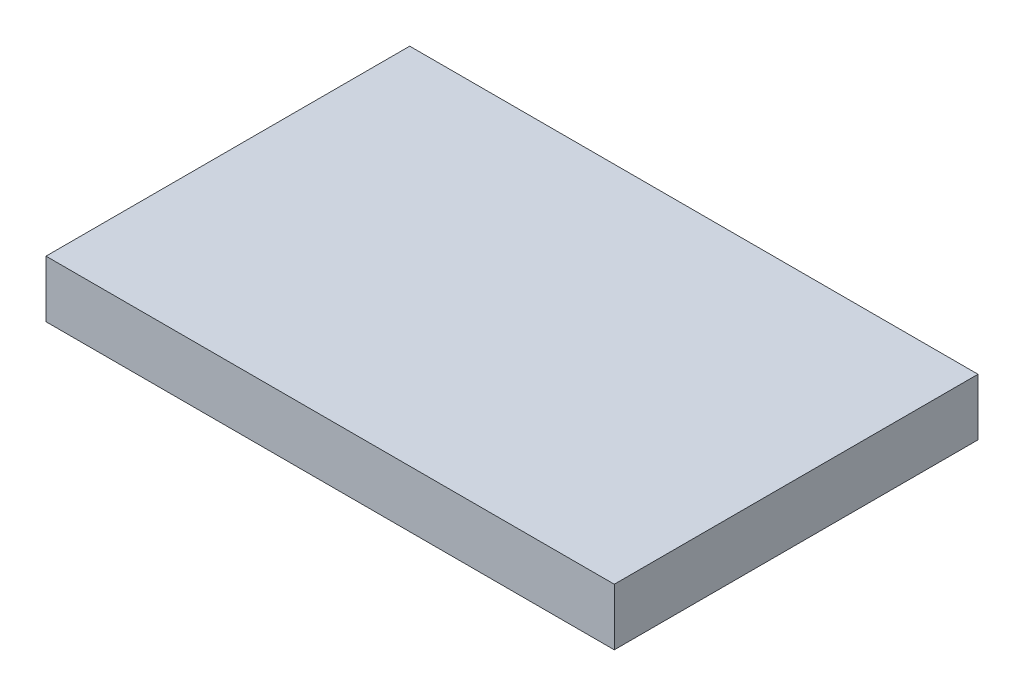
from build123d import *

# Parameters (mm, degrees)
SKETCH_1_W      = 100
SKETCH_1_H      = 64
EXTRUDE_1_DEPTH = 10


with BuildPart() as part:
    # Sketch 1 → Extrude 1 (new body)
    with BuildSketch(Plane(origin=(0, 0, 0), x_dir=(1, 0, 0), z_dir=(0, 1, 0))):
        with Locations((50, 32)):
            Rectangle(SKETCH_1_W, SKETCH_1_H)
    extrude(amount=EXTRUDE_1_DEPTH)


solid = part.part
